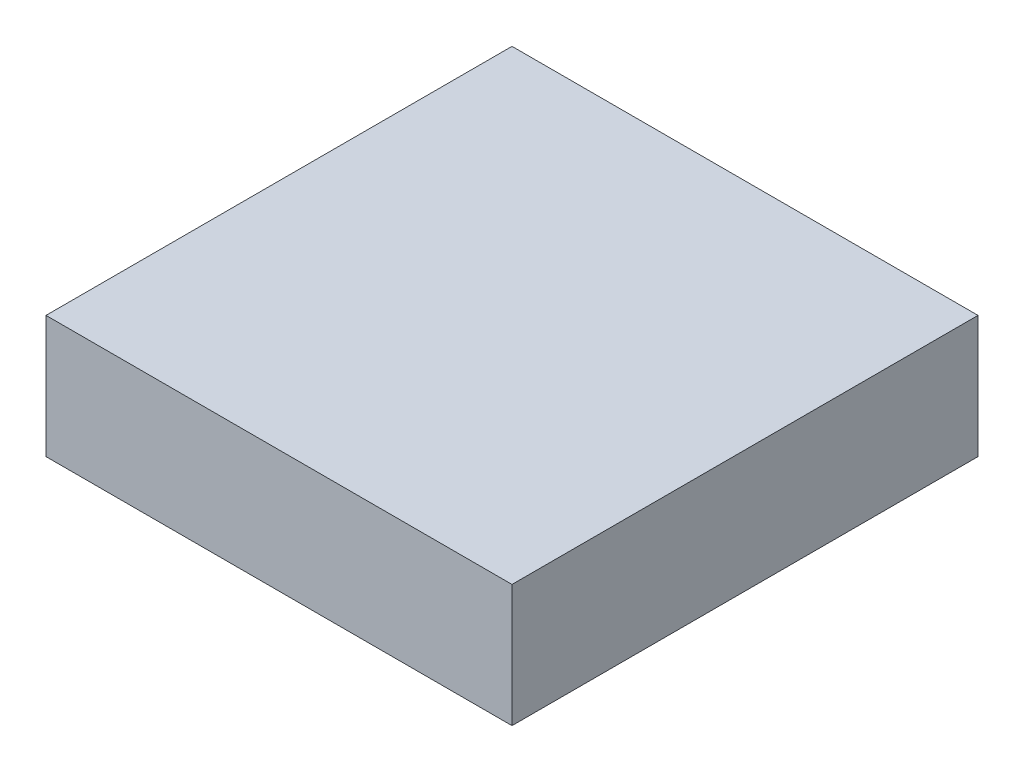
from build123d import *

# Parameters (mm, degrees)
SKETCH1_W           = 4
SKETCH1_H           = 4
BOSS_EXTRUDE1_DEPTH = 1.05


with BuildPart() as part:
    # Sketch1 → Boss-Extrude1 (new body)
    with BuildSketch(Plane(origin=(0, 0, 0), x_dir=(1, 0, 0), z_dir=(0, 1, 0))):
        Rectangle(SKETCH1_W, SKETCH1_H)
    extrude(amount=BOSS_EXTRUDE1_DEPTH)


solid = part.part
